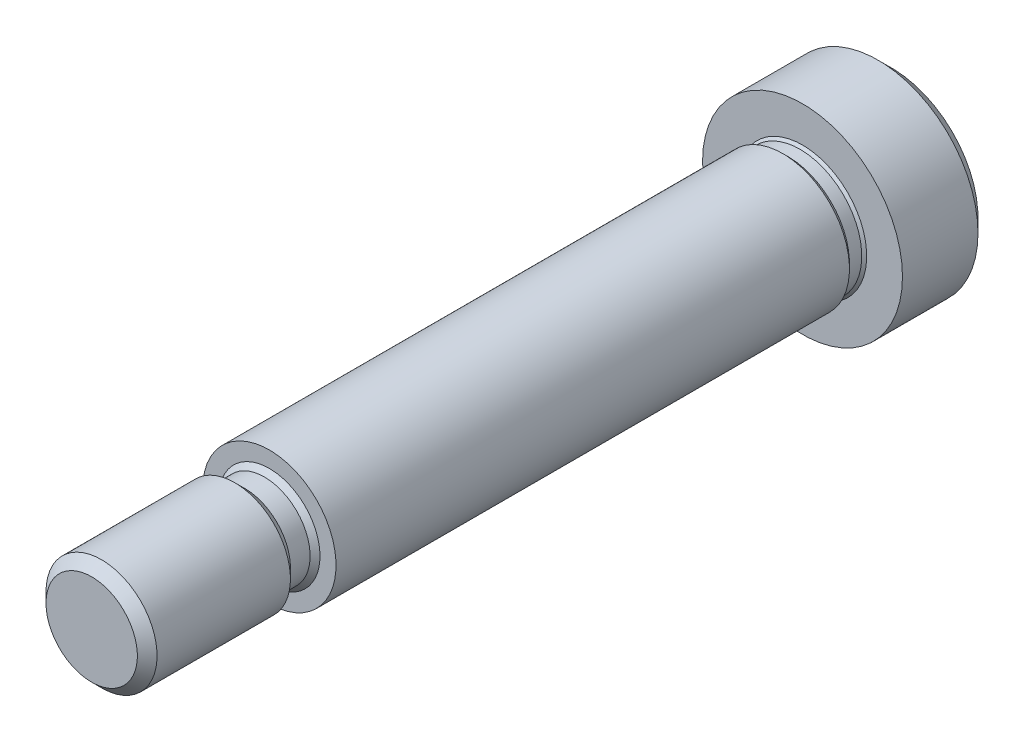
ISO-10303-21;
HEADER;
FILE_DESCRIPTION(('STEP AP214'),'2;1');
FILE_NAME('part.step','',(''),(''),'','','');
FILE_SCHEMA(('AUTOMOTIVE_DESIGN { 1 0 10303 214 1 1 1 1 }'));
ENDSEC;
DATA;
#1=APPLICATION_CONTEXT('core data for automotive mechanical design processes');
#2=APPLICATION_PROTOCOL_DEFINITION('international standard','automotive_design',2000,#1);
#3=PRODUCT_CONTEXT('',#1,'mechanical');
#4=PRODUCT('Part','Part','',(#3));
#5=PRODUCT_RELATED_PRODUCT_CATEGORY('part','',(#4));
#6=PRODUCT_DEFINITION_FORMATION('','',#4);
#7=PRODUCT_DEFINITION_CONTEXT('part definition',#1,'design');
#8=PRODUCT_DEFINITION('design','',#6,#7);
#9=PRODUCT_DEFINITION_SHAPE('','',#8);
#10=(LENGTH_UNIT() NAMED_UNIT(*) SI_UNIT(.MILLI.,.METRE.));
#11=(NAMED_UNIT(*) PLANE_ANGLE_UNIT() SI_UNIT($,.RADIAN.));
#12=(NAMED_UNIT(*) SI_UNIT($,.STERADIAN.) SOLID_ANGLE_UNIT());
#13=UNCERTAINTY_MEASURE_WITH_UNIT(LENGTH_MEASURE(1.E-05),#10,'distance_accuracy_value','');
#14=(GEOMETRIC_REPRESENTATION_CONTEXT(3) GLOBAL_UNCERTAINTY_ASSIGNED_CONTEXT((#13)) GLOBAL_UNIT_ASSIGNED_CONTEXT((#10,
#11,#12)) REPRESENTATION_CONTEXT('',''));
#15=CARTESIAN_POINT('',(0.,0.,0.));
#16=DIRECTION('',(0.,0.,1.));
#17=DIRECTION('',(1.,0.,0.));
#18=AXIS2_PLACEMENT_3D('',#15,#16,#17);
#19=CARTESIAN_POINT('',(0.,0.,-62.3527228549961));
#20=DIRECTION('',(0.,0.,-1.));
#21=DIRECTION('',(-1.,0.,0.));
#22=AXIS2_PLACEMENT_3D('',#19,#20,#21);
#23=CYLINDRICAL_SURFACE('',#22,4.7625);
#24=CARTESIAN_POINT('',(0.,0.,-36.6903));
#25=DIRECTION('',(0.,0.,-1.));
#26=DIRECTION('',(-1.,0.,0.));
#27=AXIS2_PLACEMENT_3D('',#24,#25,#26);
#28=CIRCLE('',#27,4.7625);
#29=CARTESIAN_POINT('',(-4.7625,0.,-36.6903));
#30=VERTEX_POINT('',#29);
#31=EDGE_CURVE('E118',#30,#30,#28,.T.);
#32=ORIENTED_EDGE('',*,*,#31,.F.);
#33=EDGE_LOOP('',(#32));
#34=FACE_BOUND('',#33,.T.);
#35=CARTESIAN_POINT('',(0.,0.,0.));
#36=DIRECTION('',(0.,0.,-1.));
#37=DIRECTION('',(-1.,0.,0.));
#38=AXIS2_PLACEMENT_3D('',#35,#36,#37);
#39=CIRCLE('',#38,4.7625);
#40=CARTESIAN_POINT('',(-4.7625,0.,0.));
#41=VERTEX_POINT('',#40);
#42=EDGE_CURVE('E11',#41,#41,#39,.T.);
#43=ORIENTED_EDGE('',*,*,#42,.T.);
#44=EDGE_LOOP('',(#43));
#45=FACE_BOUND('',#44,.T.);
#46=ADVANCED_FACE('F17',(#34,#45),#23,.T.);
#47=CARTESIAN_POINT('',(-4.7625,0.,0.));
#48=DIRECTION('',(0.,0.,-1.));
#49=DIRECTION('',(-1.,0.,0.));
#50=AXIS2_PLACEMENT_3D('',#47,#48,#49);
#51=PLANE('',#50);
#52=ORIENTED_EDGE('',*,*,#42,.F.);
#53=EDGE_LOOP('',(#52));
#54=FACE_BOUND('',#53,.T.);
#55=CARTESIAN_POINT('',(0.,0.,0.));
#56=DIRECTION('',(0.,0.,-1.));
#57=DIRECTION('',(-1.,0.,0.));
#58=AXIS2_PLACEMENT_3D('',#55,#56,#57);
#59=CIRCLE('',#58,3.616325);
#60=CARTESIAN_POINT('',(-3.616325,0.,0.));
#61=VERTEX_POINT('',#60);
#62=EDGE_CURVE('E24',#61,#61,#59,.T.);
#63=ORIENTED_EDGE('',*,*,#62,.T.);
#64=EDGE_LOOP('',(#63));
#65=FACE_BOUND('',#64,.T.);
#66=ADVANCED_FACE('F161',(#54,#65),#51,.F.);
#67=CARTESIAN_POINT('',(0.,0.,0.352425));
#68=DIRECTION('',(0.,0.,-1.));
#69=DIRECTION('',(-1.,0.,0.));
#70=AXIS2_PLACEMENT_3D('',#67,#68,#69);
#71=CONICAL_SURFACE('',#70,3.2639,0.785398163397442);
#72=ORIENTED_EDGE('',*,*,#62,.F.);
#73=EDGE_LOOP('',(#72));
#74=FACE_BOUND('',#73,.T.);
#75=CARTESIAN_POINT('',(0.,0.,0.352425));
#76=DIRECTION('',(0.,0.,-1.));
#77=DIRECTION('',(-1.,0.,0.));
#78=AXIS2_PLACEMENT_3D('',#75,#76,#77);
#79=CIRCLE('',#78,3.2639);
#80=CARTESIAN_POINT('',(-3.2639,0.,0.352425));
#81=VERTEX_POINT('',#80);
#82=EDGE_CURVE('E156',#81,#81,#79,.T.);
#83=ORIENTED_EDGE('',*,*,#82,.T.);
#84=EDGE_LOOP('',(#83));
#85=FACE_BOUND('',#84,.T.);
#86=ADVANCED_FACE('F163',(#74,#85),#71,.T.);
#87=CARTESIAN_POINT('',(0.,0.,-62.3527228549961));
#88=DIRECTION('',(0.,0.,-1.));
#89=DIRECTION('',(-1.,0.,0.));
#90=AXIS2_PLACEMENT_3D('',#87,#88,#89);
#91=CYLINDRICAL_SURFACE('',#90,3.2639);
#92=ORIENTED_EDGE('',*,*,#82,.F.);
#93=EDGE_LOOP('',(#92));
#94=FACE_BOUND('',#93,.T.);
#95=CARTESIAN_POINT('',(0.,0.,1.762125));
#96=DIRECTION('',(0.,0.,-1.));
#97=DIRECTION('',(-1.,0.,0.));
#98=AXIS2_PLACEMENT_3D('',#95,#96,#97);
#99=CIRCLE('',#98,3.2639);
#100=CARTESIAN_POINT('',(-3.2639,0.,1.762125));
#101=VERTEX_POINT('',#100);
#102=EDGE_CURVE('E153',#101,#101,#99,.T.);
#103=ORIENTED_EDGE('',*,*,#102,.T.);
#104=EDGE_LOOP('',(#103));
#105=FACE_BOUND('',#104,.T.);
#106=ADVANCED_FACE('F166',(#94,#105),#91,.T.);
#107=CARTESIAN_POINT('',(0.,0.,2.466975));
#108=DIRECTION('',(0.,0.,1.));
#109=DIRECTION('',(1.,0.,0.));
#110=AXIS2_PLACEMENT_3D('',#107,#108,#109);
#111=CONICAL_SURFACE('',#110,3.96875,0.785398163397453);
#112=ORIENTED_EDGE('',*,*,#102,.F.);
#113=EDGE_LOOP('',(#112));
#114=FACE_BOUND('',#113,.T.);
#115=CARTESIAN_POINT('',(0.,0.,2.466975));
#116=DIRECTION('',(0.,0.,-1.));
#117=DIRECTION('',(-1.,0.,0.));
#118=AXIS2_PLACEMENT_3D('',#115,#116,#117);
#119=CIRCLE('',#118,3.96875);
#120=CARTESIAN_POINT('',(-3.96875,0.,2.466975));
#121=VERTEX_POINT('',#120);
#122=EDGE_CURVE('E150',#121,#121,#119,.T.);
#123=ORIENTED_EDGE('',*,*,#122,.T.);
#124=EDGE_LOOP('',(#123));
#125=FACE_BOUND('',#124,.T.);
#126=ADVANCED_FACE('F172',(#114,#125),#111,.T.);
#127=CARTESIAN_POINT('',(0.,0.,-62.3527228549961));
#128=DIRECTION('',(0.,0.,-1.));
#129=DIRECTION('',(-1.,0.,0.));
#130=AXIS2_PLACEMENT_3D('',#127,#128,#129);
#131=CYLINDRICAL_SURFACE('',#130,3.96875);
#132=ORIENTED_EDGE('',*,*,#122,.F.);
#133=EDGE_LOOP('',(#132));
#134=FACE_BOUND('',#133,.T.);
#135=CARTESIAN_POINT('',(0.,0.,11.99515));
#136=DIRECTION('',(0.,0.,-1.));
#137=DIRECTION('',(-1.,0.,0.));
#138=AXIS2_PLACEMENT_3D('',#135,#136,#137);
#139=CIRCLE('',#138,3.96875);
#140=CARTESIAN_POINT('',(-3.96875,0.,11.99515));
#141=VERTEX_POINT('',#140);
#142=EDGE_CURVE('E147',#141,#141,#139,.T.);
#143=ORIENTED_EDGE('',*,*,#142,.T.);
#144=EDGE_LOOP('',(#143));
#145=FACE_BOUND('',#144,.T.);
#146=ADVANCED_FACE('F178',(#134,#145),#131,.T.);
#147=CARTESIAN_POINT('',(0.,0.,12.7));
#148=DIRECTION('',(0.,0.,-1.));
#149=DIRECTION('',(-1.,0.,0.));
#150=AXIS2_PLACEMENT_3D('',#147,#148,#149);
#151=CONICAL_SURFACE('',#150,3.2639,0.785398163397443);
#152=ORIENTED_EDGE('',*,*,#142,.F.);
#153=EDGE_LOOP('',(#152));
#154=FACE_BOUND('',#153,.T.);
#155=CARTESIAN_POINT('',(0.,0.,12.7));
#156=DIRECTION('',(0.,0.,-1.));
#157=DIRECTION('',(-1.,0.,0.));
#158=AXIS2_PLACEMENT_3D('',#155,#156,#157);
#159=CIRCLE('',#158,3.2639);
#160=CARTESIAN_POINT('',(-3.2639,0.,12.7));
#161=VERTEX_POINT('',#160);
#162=EDGE_CURVE('E144',#161,#161,#159,.T.);
#163=ORIENTED_EDGE('',*,*,#162,.T.);
#164=EDGE_LOOP('',(#163));
#165=FACE_BOUND('',#164,.T.);
#166=ADVANCED_FACE('F184',(#154,#165),#151,.T.);
#167=CARTESIAN_POINT('',(-3.2639,0.,12.7));
#168=DIRECTION('',(0.,0.,-1.));
#169=DIRECTION('',(-1.,0.,0.));
#170=AXIS2_PLACEMENT_3D('',#167,#168,#169);
#171=PLANE('',#170);
#172=ORIENTED_EDGE('',*,*,#162,.F.);
#173=EDGE_LOOP('',(#172));
#174=FACE_BOUND('',#173,.T.);
#175=ADVANCED_FACE('F190',(#174),#171,.F.);
#176=CARTESIAN_POINT('',(-6.19125,0.,-44.45));
#177=DIRECTION('',(0.,0.,1.));
#178=DIRECTION('',(1.,0.,0.));
#179=AXIS2_PLACEMENT_3D('',#176,#177,#178);
#180=PLANE('',#179);
#181=DIRECTION('',(-0.5,-0.866025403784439,0.));
#182=VECTOR('',#181,1.);
#183=CARTESIAN_POINT('',(2.74963065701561,0.,-44.45));
#184=LINE('',#183,#182);
#185=CARTESIAN_POINT('',(2.74963065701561,0.,-44.45));
#186=VERTEX_POINT('',#185);
#187=CARTESIAN_POINT('',(1.37481532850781,-2.38125,-44.45));
#188=VERTEX_POINT('',#187);
#189=EDGE_CURVE('E105',#186,#188,#184,.T.);
#190=ORIENTED_EDGE('',*,*,#189,.F.);
#191=DIRECTION('',(0.5,-0.866025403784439,0.));
#192=VECTOR('',#191,1.);
#193=CARTESIAN_POINT('',(1.37481532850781,2.38125,-44.45));
#194=LINE('',#193,#192);
#195=CARTESIAN_POINT('',(1.37481532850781,2.38125,-44.45));
#196=VERTEX_POINT('',#195);
#197=EDGE_CURVE('E31',#196,#186,#194,.T.);
#198=ORIENTED_EDGE('',*,*,#197,.F.);
#199=DIRECTION('',(1.,0.,0.));
#200=VECTOR('',#199,1.);
#201=CARTESIAN_POINT('',(-1.37481532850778,2.38125,-44.45));
#202=LINE('',#201,#200);
#203=CARTESIAN_POINT('',(-1.37481532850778,2.38125,-44.45));
#204=VERTEX_POINT('',#203);
#205=EDGE_CURVE('E114',#204,#196,#202,.T.);
#206=ORIENTED_EDGE('',*,*,#205,.F.);
#207=DIRECTION('',(0.5,0.866025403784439,0.));
#208=VECTOR('',#207,1.);
#209=CARTESIAN_POINT('',(-2.74963065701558,0.,-44.45));
#210=LINE('',#209,#208);
#211=CARTESIAN_POINT('',(-2.74963065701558,0.,-44.45));
#212=VERTEX_POINT('',#211);
#213=EDGE_CURVE('E112',#212,#204,#210,.T.);
#214=ORIENTED_EDGE('',*,*,#213,.F.);
#215=DIRECTION('',(-0.5,0.866025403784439,0.));
#216=VECTOR('',#215,1.);
#217=CARTESIAN_POINT('',(-1.37481532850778,-2.38125,-44.45));
#218=LINE('',#217,#216);
#219=CARTESIAN_POINT('',(-1.37481532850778,-2.38125,-44.45));
#220=VERTEX_POINT('',#219);
#221=EDGE_CURVE('E79',#220,#212,#218,.T.);
#222=ORIENTED_EDGE('',*,*,#221,.F.);
#223=DIRECTION('',(-1.,0.,0.));
#224=VECTOR('',#223,1.);
#225=CARTESIAN_POINT('',(1.37481532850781,-2.38125,-44.45));
#226=LINE('',#225,#224);
#227=EDGE_CURVE('E108',#188,#220,#226,.T.);
#228=ORIENTED_EDGE('',*,*,#227,.F.);
#229=EDGE_LOOP('',(#190,#198,#206,#214,#222,#228));
#230=FACE_BOUND('',#229,.T.);
#231=CARTESIAN_POINT('',(0.,0.,-44.45));
#232=DIRECTION('',(0.,0.,-1.));
#233=DIRECTION('',(-1.,0.,0.));
#234=AXIS2_PLACEMENT_3D('',#231,#232,#233);
#235=CIRCLE('',#234,6.19125);
#236=CARTESIAN_POINT('',(-6.19125,0.,-44.45));
#237=VERTEX_POINT('',#236);
#238=EDGE_CURVE('E141',#237,#237,#235,.T.);
#239=ORIENTED_EDGE('',*,*,#238,.T.);
#240=EDGE_LOOP('',(#239));
#241=FACE_BOUND('',#240,.T.);
#242=ADVANCED_FACE('F195',(#230,#241),#180,.F.);
#243=CARTESIAN_POINT('',(0.,0.,-43.4975));
#244=DIRECTION('',(0.,0.,1.));
#245=DIRECTION('',(1.,0.,0.));
#246=AXIS2_PLACEMENT_3D('',#243,#244,#245);
#247=CONICAL_SURFACE('',#246,7.14375,0.785398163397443);
#248=ORIENTED_EDGE('',*,*,#238,.F.);
#249=EDGE_LOOP('',(#248));
#250=FACE_BOUND('',#249,.T.);
#251=CARTESIAN_POINT('',(0.,0.,-43.4975));
#252=DIRECTION('',(0.,0.,-1.));
#253=DIRECTION('',(-1.,0.,0.));
#254=AXIS2_PLACEMENT_3D('',#251,#252,#253);
#255=CIRCLE('',#254,7.14375);
#256=CARTESIAN_POINT('',(-7.14375,0.,-43.4975));
#257=VERTEX_POINT('',#256);
#258=EDGE_CURVE('E138',#257,#257,#255,.T.);
#259=ORIENTED_EDGE('',*,*,#258,.T.);
#260=EDGE_LOOP('',(#259));
#261=FACE_BOUND('',#260,.T.);
#262=ADVANCED_FACE('F203',(#250,#261),#247,.T.);
#263=CARTESIAN_POINT('',(0.,0.,-62.3527228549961));
#264=DIRECTION('',(0.,0.,-1.));
#265=DIRECTION('',(-1.,0.,0.));
#266=AXIS2_PLACEMENT_3D('',#263,#264,#265);
#267=CYLINDRICAL_SURFACE('',#266,7.14375);
#268=ORIENTED_EDGE('',*,*,#258,.F.);
#269=EDGE_LOOP('',(#268));
#270=FACE_BOUND('',#269,.T.);
#271=CARTESIAN_POINT('',(0.,0.,-38.1));
#272=DIRECTION('',(0.,0.,-1.));
#273=DIRECTION('',(-1.,0.,0.));
#274=AXIS2_PLACEMENT_3D('',#271,#272,#273);
#275=CIRCLE('',#274,7.14375);
#276=CARTESIAN_POINT('',(-7.14375,0.,-38.1));
#277=VERTEX_POINT('',#276);
#278=EDGE_CURVE('E135',#277,#277,#275,.T.);
#279=ORIENTED_EDGE('',*,*,#278,.T.);
#280=EDGE_LOOP('',(#279));
#281=FACE_BOUND('',#280,.T.);
#282=ADVANCED_FACE('F243',(#270,#281),#267,.T.);
#283=CARTESIAN_POINT('',(-4.58628750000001,0.,-38.1));
#284=DIRECTION('',(0.,0.,-1.));
#285=DIRECTION('',(-1.,0.,0.));
#286=AXIS2_PLACEMENT_3D('',#283,#284,#285);
#287=PLANE('',#286);
#288=ORIENTED_EDGE('',*,*,#278,.F.);
#289=EDGE_LOOP('',(#288));
#290=FACE_BOUND('',#289,.T.);
#291=CARTESIAN_POINT('',(0.,0.,-38.1));
#292=DIRECTION('',(0.,0.,-1.));
#293=DIRECTION('',(-1.,0.,0.));
#294=AXIS2_PLACEMENT_3D('',#291,#292,#293);
#295=CIRCLE('',#294,4.58628750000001);
#296=CARTESIAN_POINT('',(-4.58628750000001,0.,-38.1));
#297=VERTEX_POINT('',#296);
#298=EDGE_CURVE('E132',#297,#297,#295,.T.);
#299=ORIENTED_EDGE('',*,*,#298,.T.);
#300=EDGE_LOOP('',(#299));
#301=FACE_BOUND('',#300,.T.);
#302=ADVANCED_FACE('F239',(#290,#301),#287,.F.);
#303=CARTESIAN_POINT('',(0.,0.,-37.9237875));
#304=DIRECTION('',(0.,0.,-1.));
#305=DIRECTION('',(-1.,0.,0.));
#306=AXIS2_PLACEMENT_3D('',#303,#304,#305);
#307=CONICAL_SURFACE('',#306,4.410075,0.78539816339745);
#308=ORIENTED_EDGE('',*,*,#298,.F.);
#309=EDGE_LOOP('',(#308));
#310=FACE_BOUND('',#309,.T.);
#311=CARTESIAN_POINT('',(0.,0.,-37.9237875));
#312=DIRECTION('',(0.,0.,-1.));
#313=DIRECTION('',(-1.,0.,0.));
#314=AXIS2_PLACEMENT_3D('',#311,#312,#313);
#315=CIRCLE('',#314,4.410075);
#316=CARTESIAN_POINT('',(-4.410075,0.,-37.9237875));
#317=VERTEX_POINT('',#316);
#318=EDGE_CURVE('E129',#317,#317,#315,.T.);
#319=ORIENTED_EDGE('',*,*,#318,.T.);
#320=EDGE_LOOP('',(#319));
#321=FACE_BOUND('',#320,.T.);
#322=ADVANCED_FACE('F231',(#310,#321),#307,.T.);
#323=CARTESIAN_POINT('',(0.,0.,-62.3527228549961));
#324=DIRECTION('',(0.,0.,-1.));
#325=DIRECTION('',(-1.,0.,0.));
#326=AXIS2_PLACEMENT_3D('',#323,#324,#325);
#327=CYLINDRICAL_SURFACE('',#326,4.410075);
#328=ORIENTED_EDGE('',*,*,#318,.F.);
#329=EDGE_LOOP('',(#328));
#330=FACE_BOUND('',#329,.T.);
#331=CARTESIAN_POINT('',(0.,0.,-37.042725));
#332=DIRECTION('',(0.,0.,-1.));
#333=DIRECTION('',(-1.,0.,0.));
#334=AXIS2_PLACEMENT_3D('',#331,#332,#333);
#335=CIRCLE('',#334,4.410075);
#336=CARTESIAN_POINT('',(-4.410075,0.,-37.042725));
#337=VERTEX_POINT('',#336);
#338=EDGE_CURVE('E126',#337,#337,#335,.T.);
#339=ORIENTED_EDGE('',*,*,#338,.T.);
#340=EDGE_LOOP('',(#339));
#341=FACE_BOUND('',#340,.T.);
#342=ADVANCED_FACE('F220',(#330,#341),#327,.T.);
#343=CARTESIAN_POINT('',(0.,0.,-36.6903));
#344=DIRECTION('',(0.,0.,1.));
#345=DIRECTION('',(1.,0.,0.));
#346=AXIS2_PLACEMENT_3D('',#343,#344,#345);
#347=CONICAL_SURFACE('',#346,4.7625,0.785398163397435);
#348=ORIENTED_EDGE('',*,*,#338,.F.);
#349=EDGE_LOOP('',(#348));
#350=FACE_BOUND('',#349,.T.);
#351=ORIENTED_EDGE('',*,*,#31,.T.);
#352=EDGE_LOOP('',(#351));
#353=FACE_BOUND('',#352,.T.);
#354=ADVANCED_FACE('F217',(#350,#353),#347,.T.);
#355=CARTESIAN_POINT('',(1.37481532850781,2.38125,-40.2166666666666));
#356=DIRECTION('',(0.866025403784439,0.5,0.));
#357=DIRECTION('',(-0.5,0.866025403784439,0.));
#358=AXIS2_PLACEMENT_3D('',#355,#356,#357);
#359=PLANE('',#358);
#360=ORIENTED_EDGE('',*,*,#197,.T.);
#361=DIRECTION('',(0.,0.,-1.));
#362=VECTOR('',#361,1.);
#363=CARTESIAN_POINT('',(2.74963065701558,0.,-40.2166666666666));
#364=LINE('',#363,#362);
#365=CARTESIAN_POINT('',(2.74963065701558,0.,-40.2166666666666));
#366=VERTEX_POINT('',#365);
#367=EDGE_CURVE('E61',#366,#186,#364,.T.);
#368=ORIENTED_EDGE('',*,*,#367,.F.);
#369=DIRECTION('',(0.5,-0.866025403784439,0.));
#370=VECTOR('',#369,1.);
#371=CARTESIAN_POINT('',(1.37481532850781,2.38125,-40.2166666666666));
#372=LINE('',#371,#370);
#373=CARTESIAN_POINT('',(1.37481532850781,2.38125,-40.2166666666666));
#374=VERTEX_POINT('',#373);
#375=EDGE_CURVE('E116',#374,#366,#372,.T.);
#376=ORIENTED_EDGE('',*,*,#375,.F.);
#377=DIRECTION('',(0.,0.,-1.));
#378=VECTOR('',#377,1.);
#379=CARTESIAN_POINT('',(1.37481532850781,2.38125,-40.2166666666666));
#380=LINE('',#379,#378);
#381=EDGE_CURVE('E39',#374,#196,#380,.T.);
#382=ORIENTED_EDGE('',*,*,#381,.T.);
#383=EDGE_LOOP('',(#360,#368,#376,#382));
#384=FACE_BOUND('',#383,.T.);
#385=ADVANCED_FACE('F219',(#384),#359,.F.);
#386=CARTESIAN_POINT('',(-1.37481532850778,2.38125,-40.2166666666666));
#387=DIRECTION('',(0.,1.,0.));
#388=DIRECTION('',(-1.,0.,0.));
#389=AXIS2_PLACEMENT_3D('',#386,#387,#388);
#390=PLANE('',#389);
#391=ORIENTED_EDGE('',*,*,#205,.T.);
#392=ORIENTED_EDGE('',*,*,#381,.F.);
#393=DIRECTION('',(1.,0.,0.));
#394=VECTOR('',#393,1.);
#395=CARTESIAN_POINT('',(-1.37481532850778,2.38125,-40.2166666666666));
#396=LINE('',#395,#394);
#397=CARTESIAN_POINT('',(-1.37481532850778,2.38125,-40.2166666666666));
#398=VERTEX_POINT('',#397);
#399=EDGE_CURVE('E91',#398,#374,#396,.T.);
#400=ORIENTED_EDGE('',*,*,#399,.F.);
#401=DIRECTION('',(0.,0.,-1.));
#402=VECTOR('',#401,1.);
#403=CARTESIAN_POINT('',(-1.37481532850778,2.38125,-40.2166666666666));
#404=LINE('',#403,#402);
#405=EDGE_CURVE('E83',#398,#204,#404,.T.);
#406=ORIENTED_EDGE('',*,*,#405,.T.);
#407=EDGE_LOOP('',(#391,#392,#400,#406));
#408=FACE_BOUND('',#407,.T.);
#409=ADVANCED_FACE('F229',(#408),#390,.F.);
#410=CARTESIAN_POINT('',(-2.74963065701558,0.,-40.2166666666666));
#411=DIRECTION('',(-0.866025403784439,0.5,0.));
#412=DIRECTION('',(-0.5,-0.866025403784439,0.));
#413=AXIS2_PLACEMENT_3D('',#410,#411,#412);
#414=PLANE('',#413);
#415=ORIENTED_EDGE('',*,*,#213,.T.);
#416=ORIENTED_EDGE('',*,*,#405,.F.);
#417=DIRECTION('',(0.5,0.866025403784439,0.));
#418=VECTOR('',#417,1.);
#419=CARTESIAN_POINT('',(-2.74963065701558,0.,-40.2166666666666));
#420=LINE('',#419,#418);
#421=CARTESIAN_POINT('',(-2.74963065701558,0.,-40.2166666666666));
#422=VERTEX_POINT('',#421);
#423=EDGE_CURVE('E87',#422,#398,#420,.T.);
#424=ORIENTED_EDGE('',*,*,#423,.F.);
#425=DIRECTION('',(0.,0.,-1.));
#426=VECTOR('',#425,1.);
#427=CARTESIAN_POINT('',(-2.74963065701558,0.,-40.2166666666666));
#428=LINE('',#427,#426);
#429=EDGE_CURVE('E72',#422,#212,#428,.T.);
#430=ORIENTED_EDGE('',*,*,#429,.T.);
#431=EDGE_LOOP('',(#415,#416,#424,#430));
#432=FACE_BOUND('',#431,.T.);
#433=ADVANCED_FACE('F88',(#432),#414,.F.);
#434=CARTESIAN_POINT('',(-1.37481532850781,-2.38125,-40.2166666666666));
#435=DIRECTION('',(-0.866025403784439,-0.5,0.));
#436=DIRECTION('',(0.5,-0.866025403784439,0.));
#437=AXIS2_PLACEMENT_3D('',#434,#435,#436);
#438=PLANE('',#437);
#439=ORIENTED_EDGE('',*,*,#221,.T.);
#440=ORIENTED_EDGE('',*,*,#429,.F.);
#441=DIRECTION('',(-0.5,0.866025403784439,0.));
#442=VECTOR('',#441,1.);
#443=CARTESIAN_POINT('',(-1.37481532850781,-2.38125,-40.2166666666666));
#444=LINE('',#443,#442);
#445=CARTESIAN_POINT('',(-1.37481532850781,-2.38125,-40.2166666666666));
#446=VERTEX_POINT('',#445);
#447=EDGE_CURVE('E76',#446,#422,#444,.T.);
#448=ORIENTED_EDGE('',*,*,#447,.F.);
#449=DIRECTION('',(0.,0.,-1.));
#450=VECTOR('',#449,1.);
#451=CARTESIAN_POINT('',(-1.37481532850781,-2.38125,-40.2166666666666));
#452=LINE('',#451,#450);
#453=EDGE_CURVE('E84',#446,#220,#452,.T.);
#454=ORIENTED_EDGE('',*,*,#453,.T.);
#455=EDGE_LOOP('',(#439,#440,#448,#454));
#456=FACE_BOUND('',#455,.T.);
#457=ADVANCED_FACE('F74',(#456),#438,.F.);
#458=CARTESIAN_POINT('',(1.37481532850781,-2.38125,-40.2166666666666));
#459=DIRECTION('',(0.,-1.,0.));
#460=DIRECTION('',(1.,0.,0.));
#461=AXIS2_PLACEMENT_3D('',#458,#459,#460);
#462=PLANE('',#461);
#463=ORIENTED_EDGE('',*,*,#227,.T.);
#464=ORIENTED_EDGE('',*,*,#453,.F.);
#465=DIRECTION('',(-1.,0.,0.));
#466=VECTOR('',#465,1.);
#467=CARTESIAN_POINT('',(1.37481532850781,-2.38125,-40.2166666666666));
#468=LINE('',#467,#466);
#469=CARTESIAN_POINT('',(1.37481532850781,-2.38125,-40.2166666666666));
#470=VERTEX_POINT('',#469);
#471=EDGE_CURVE('E97',#470,#446,#468,.T.);
#472=ORIENTED_EDGE('',*,*,#471,.F.);
#473=DIRECTION('',(0.,0.,-1.));
#474=VECTOR('',#473,1.);
#475=CARTESIAN_POINT('',(1.37481532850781,-2.38125,-40.2166666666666));
#476=LINE('',#475,#474);
#477=EDGE_CURVE('E121',#470,#188,#476,.T.);
#478=ORIENTED_EDGE('',*,*,#477,.T.);
#479=EDGE_LOOP('',(#463,#464,#472,#478));
#480=FACE_BOUND('',#479,.T.);
#481=ADVANCED_FACE('F363',(#480),#462,.F.);
#482=CARTESIAN_POINT('',(2.74963065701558,0.,-40.2166666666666));
#483=DIRECTION('',(0.866025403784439,-0.5,0.));
#484=DIRECTION('',(0.5,0.866025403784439,0.));
#485=AXIS2_PLACEMENT_3D('',#482,#483,#484);
#486=PLANE('',#485);
#487=ORIENTED_EDGE('',*,*,#189,.T.);
#488=ORIENTED_EDGE('',*,*,#477,.F.);
#489=DIRECTION('',(-0.5,-0.866025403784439,0.));
#490=VECTOR('',#489,1.);
#491=CARTESIAN_POINT('',(2.74963065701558,0.,-40.2166666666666));
#492=LINE('',#491,#490);
#493=EDGE_CURVE('E99',#366,#470,#492,.T.);
#494=ORIENTED_EDGE('',*,*,#493,.F.);
#495=ORIENTED_EDGE('',*,*,#367,.T.);
#496=EDGE_LOOP('',(#487,#488,#494,#495));
#497=FACE_BOUND('',#496,.T.);
#498=ADVANCED_FACE('F374',(#497),#486,.F.);
#499=CARTESIAN_POINT('',(1.37481532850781,2.38125,-40.2166666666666));
#500=DIRECTION('',(0.,0.,1.));
#501=DIRECTION('',(1.,0.,0.));
#502=AXIS2_PLACEMENT_3D('',#499,#500,#501);
#503=PLANE('',#502);
#504=ORIENTED_EDGE('',*,*,#375,.T.);
#505=ORIENTED_EDGE('',*,*,#493,.T.);
#506=ORIENTED_EDGE('',*,*,#471,.T.);
#507=ORIENTED_EDGE('',*,*,#447,.T.);
#508=ORIENTED_EDGE('',*,*,#423,.T.);
#509=ORIENTED_EDGE('',*,*,#399,.T.);
#510=EDGE_LOOP('',(#504,#505,#506,#507,#508,#509));
#511=FACE_BOUND('',#510,.T.);
#512=ADVANCED_FACE('F94',(#511),#503,.F.);
#513=CLOSED_SHELL('',(#46,#66,#86,#106,#126,#146,#166,#175,#242,#262,#282,#302,#322,#342,#354,
#385,#409,#433,#457,#481,#498,#512));
#514=MANIFOLD_SOLID_BREP('B1',#513);
#515=ADVANCED_BREP_SHAPE_REPRESENTATION('',(#18,#514),#14);
#516=SHAPE_DEFINITION_REPRESENTATION(#9,#515);
ENDSEC;
END-ISO-10303-21;
